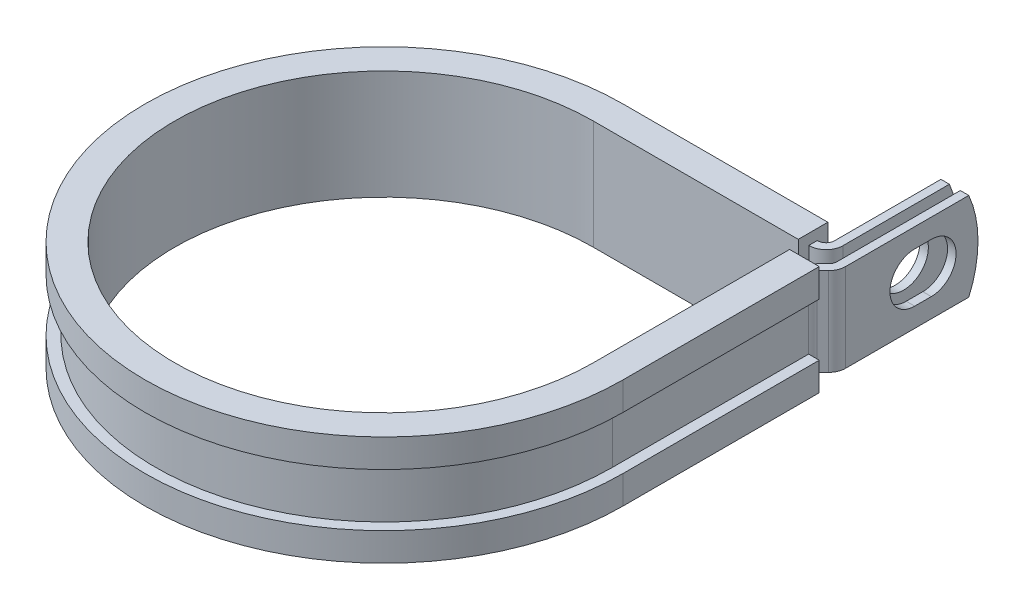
ISO-10303-21;
HEADER;
FILE_DESCRIPTION(('STEP AP214'),'2;1');
FILE_NAME('part.step','',(''),(''),'','','');
FILE_SCHEMA(('AUTOMOTIVE_DESIGN { 1 0 10303 214 1 1 1 1 }'));
ENDSEC;
DATA;
#1=APPLICATION_CONTEXT('core data for automotive mechanical design processes');
#2=APPLICATION_PROTOCOL_DEFINITION('international standard','automotive_design',2000,#1);
#3=PRODUCT_CONTEXT('',#1,'mechanical');
#4=PRODUCT('Part','Part','',(#3));
#5=PRODUCT_RELATED_PRODUCT_CATEGORY('part','',(#4));
#6=PRODUCT_DEFINITION_FORMATION('','',#4);
#7=PRODUCT_DEFINITION_CONTEXT('part definition',#1,'design');
#8=PRODUCT_DEFINITION('design','',#6,#7);
#9=PRODUCT_DEFINITION_SHAPE('','',#8);
#10=(LENGTH_UNIT() NAMED_UNIT(*) SI_UNIT(.MILLI.,.METRE.));
#11=(NAMED_UNIT(*) PLANE_ANGLE_UNIT() SI_UNIT($,.RADIAN.));
#12=(NAMED_UNIT(*) SI_UNIT($,.STERADIAN.) SOLID_ANGLE_UNIT());
#13=UNCERTAINTY_MEASURE_WITH_UNIT(LENGTH_MEASURE(1.E-05),#10,'distance_accuracy_value','');
#14=(GEOMETRIC_REPRESENTATION_CONTEXT(3) GLOBAL_UNCERTAINTY_ASSIGNED_CONTEXT((#13)) GLOBAL_UNIT_ASSIGNED_CONTEXT((#10,
#11,#12)) REPRESENTATION_CONTEXT('',''));
#15=CARTESIAN_POINT('',(0.,0.,0.));
#16=DIRECTION('',(0.,0.,1.));
#17=DIRECTION('',(1.,0.,0.));
#18=AXIS2_PLACEMENT_3D('',#15,#16,#17);
#19=CARTESIAN_POINT('',(32.3647698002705,-6.35,-31.6865));
#20=DIRECTION('',(0.,1.,0.));
#21=DIRECTION('',(1.,0.,0.));
#22=AXIS2_PLACEMENT_3D('',#19,#20,#21);
#23=PLANE('',#22);
#24=DIRECTION('',(0.,0.,-1.));
#25=VECTOR('',#24,1.);
#26=CARTESIAN_POINT('',(29.5199698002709,-6.35,-31.6865));
#27=LINE('',#26,#25);
#28=CARTESIAN_POINT('',(29.5199698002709,-6.35,-31.6865));
#29=VERTEX_POINT('',#28);
#30=CARTESIAN_POINT('',(29.5199698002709,-6.35,-32.9057));
#31=VERTEX_POINT('',#30);
#32=EDGE_CURVE('E524',#29,#31,#27,.T.);
#33=ORIENTED_EDGE('',*,*,#32,.T.);
#34=DIRECTION('',(1.,0.,0.));
#35=VECTOR('',#34,1.);
#36=CARTESIAN_POINT('',(0.,-6.35,-32.9057));
#37=LINE('',#36,#35);
#38=CARTESIAN_POINT('',(29.5707698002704,-6.35,-32.9057));
#39=VERTEX_POINT('',#38);
#40=EDGE_CURVE('E411',#39,#31,#37,.F.);
#41=ORIENTED_EDGE('',*,*,#40,.F.);
#42=CARTESIAN_POINT('',(29.5707698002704,-6.35,-34.1249));
#43=DIRECTION('',(0.,1.,0.));
#44=DIRECTION('',(1.,0.,0.));
#45=AXIS2_PLACEMENT_3D('',#42,#43,#44);
#46=CIRCLE('',#45,1.2192);
#47=CARTESIAN_POINT('',(30.7899698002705,-6.35,-34.1249));
#48=VERTEX_POINT('',#47);
#49=EDGE_CURVE('E409',#48,#39,#46,.F.);
#50=ORIENTED_EDGE('',*,*,#49,.F.);
#51=DIRECTION('',(0.,0.,1.));
#52=VECTOR('',#51,1.);
#53=CARTESIAN_POINT('',(30.7899698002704,-6.35,-50.7746));
#54=LINE('',#53,#52);
#55=CARTESIAN_POINT('',(30.7899698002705,-6.35,-49.4492778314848));
#56=VERTEX_POINT('',#55);
#57=EDGE_CURVE('E407',#56,#48,#54,.T.);
#58=ORIENTED_EDGE('',*,*,#57,.F.);
#59=DIRECTION('',(-1.,0.,0.));
#60=VECTOR('',#59,1.);
#61=CARTESIAN_POINT('',(34.8031698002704,-6.35,-49.4492778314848));
#62=LINE('',#61,#60);
#63=CARTESIAN_POINT('',(32.0091698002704,-6.35,-49.4492778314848));
#64=VERTEX_POINT('',#63);
#65=EDGE_CURVE('E12',#64,#56,#62,.T.);
#66=ORIENTED_EDGE('',*,*,#65,.F.);
#67=DIRECTION('',(0.,0.,1.));
#68=VECTOR('',#67,1.);
#69=CARTESIAN_POINT('',(32.0091698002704,-6.35,-50.7746));
#70=LINE('',#69,#68);
#71=CARTESIAN_POINT('',(32.0091698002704,-6.35,-34.1249));
#72=VERTEX_POINT('',#71);
#73=EDGE_CURVE('E405',#64,#72,#70,.T.);
#74=ORIENTED_EDGE('',*,*,#73,.T.);
#75=CARTESIAN_POINT('',(29.5707698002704,-6.35,-34.1249));
#76=DIRECTION('',(0.,-1.,0.));
#77=DIRECTION('',(0.,0.,1.));
#78=AXIS2_PLACEMENT_3D('',#75,#76,#77);
#79=CIRCLE('',#78,2.4384);
#80=CARTESIAN_POINT('',(29.5707698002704,-6.35,-31.6865));
#81=VERTEX_POINT('',#80);
#82=EDGE_CURVE('E402',#72,#81,#79,.T.);
#83=ORIENTED_EDGE('',*,*,#82,.T.);
#84=DIRECTION('',(-1.,0.,0.));
#85=VECTOR('',#84,1.);
#86=CARTESIAN_POINT('',(0.,-6.35,-31.6865));
#87=LINE('',#86,#85);
#88=EDGE_CURVE('E399',#81,#29,#87,.T.);
#89=ORIENTED_EDGE('',*,*,#88,.T.);
#90=EDGE_LOOP('',(#33,#41,#50,#58,#66,#74,#83,#89));
#91=FACE_BOUND('',#90,.T.);
#92=ADVANCED_FACE('F55',(#91),#23,.F.);
#93=CARTESIAN_POINT('',(32.3647698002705,6.35,-31.6865));
#94=DIRECTION('',(0.,1.,0.));
#95=DIRECTION('',(1.,0.,0.));
#96=AXIS2_PLACEMENT_3D('',#93,#94,#95);
#97=PLANE('',#96);
#98=DIRECTION('',(1.,0.,0.));
#99=VECTOR('',#98,1.);
#100=CARTESIAN_POINT('',(0.,6.35,-32.9057));
#101=LINE('',#100,#99);
#102=CARTESIAN_POINT('',(29.5707698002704,6.35,-32.9057));
#103=VERTEX_POINT('',#102);
#104=CARTESIAN_POINT('',(29.5199698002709,6.35,-32.9057));
#105=VERTEX_POINT('',#104);
#106=EDGE_CURVE('E369',#103,#105,#101,.F.);
#107=ORIENTED_EDGE('',*,*,#106,.T.);
#108=DIRECTION('',(0.,0.,1.));
#109=VECTOR('',#108,1.);
#110=CARTESIAN_POINT('',(29.5199698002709,6.35,-32.9057));
#111=LINE('',#110,#109);
#112=CARTESIAN_POINT('',(29.5199698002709,6.35,-31.6865));
#113=VERTEX_POINT('',#112);
#114=EDGE_CURVE('E518',#105,#113,#111,.T.);
#115=ORIENTED_EDGE('',*,*,#114,.T.);
#116=DIRECTION('',(-1.,0.,0.));
#117=VECTOR('',#116,1.);
#118=CARTESIAN_POINT('',(0.,6.35,-31.6865));
#119=LINE('',#118,#117);
#120=CARTESIAN_POINT('',(29.5707698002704,6.35,-31.6865));
#121=VERTEX_POINT('',#120);
#122=EDGE_CURVE('E626',#121,#113,#119,.T.);
#123=ORIENTED_EDGE('',*,*,#122,.F.);
#124=CARTESIAN_POINT('',(29.5707698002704,6.35,-34.1249));
#125=DIRECTION('',(0.,-1.,0.));
#126=DIRECTION('',(0.,0.,1.));
#127=AXIS2_PLACEMENT_3D('',#124,#125,#126);
#128=CIRCLE('',#127,2.4384);
#129=CARTESIAN_POINT('',(32.0091698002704,6.35,-34.1249));
#130=VERTEX_POINT('',#129);
#131=EDGE_CURVE('E371',#130,#121,#128,.T.);
#132=ORIENTED_EDGE('',*,*,#131,.F.);
#133=DIRECTION('',(0.,0.,1.));
#134=VECTOR('',#133,1.);
#135=CARTESIAN_POINT('',(32.0091698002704,6.35,-50.7746));
#136=LINE('',#135,#134);
#137=CARTESIAN_POINT('',(32.0091698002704,6.35,-49.4492778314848));
#138=VERTEX_POINT('',#137);
#139=EDGE_CURVE('E362',#138,#130,#136,.T.);
#140=ORIENTED_EDGE('',*,*,#139,.F.);
#141=DIRECTION('',(-1.,0.,0.));
#142=VECTOR('',#141,1.);
#143=CARTESIAN_POINT('',(34.8031698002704,6.35,-49.4492778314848));
#144=LINE('',#143,#142);
#145=CARTESIAN_POINT('',(30.7899698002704,6.35,-49.4492778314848));
#146=VERTEX_POINT('',#145);
#147=EDGE_CURVE('E63',#138,#146,#144,.T.);
#148=ORIENTED_EDGE('',*,*,#147,.T.);
#149=DIRECTION('',(0.,0.,1.));
#150=VECTOR('',#149,1.);
#151=CARTESIAN_POINT('',(30.7899698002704,6.35,-50.7746));
#152=LINE('',#151,#150);
#153=CARTESIAN_POINT('',(30.7899698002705,6.35,-34.1249));
#154=VERTEX_POINT('',#153);
#155=EDGE_CURVE('E359',#146,#154,#152,.T.);
#156=ORIENTED_EDGE('',*,*,#155,.T.);
#157=CARTESIAN_POINT('',(29.5707698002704,6.35,-34.1249));
#158=DIRECTION('',(0.,1.,0.));
#159=DIRECTION('',(1.,0.,0.));
#160=AXIS2_PLACEMENT_3D('',#157,#158,#159);
#161=CIRCLE('',#160,1.2192);
#162=EDGE_CURVE('E367',#154,#103,#161,.F.);
#163=ORIENTED_EDGE('',*,*,#162,.T.);
#164=EDGE_LOOP('',(#107,#115,#123,#132,#140,#148,#156,#163));
#165=FACE_BOUND('',#164,.T.);
#166=ADVANCED_FACE('F358',(#165),#97,.T.);
#167=CARTESIAN_POINT('',(0.,6.35,-31.6865));
#168=DIRECTION('',(0.,0.,1.));
#169=DIRECTION('',(1.,0.,0.));
#170=AXIS2_PLACEMENT_3D('',#167,#168,#169);
#171=PLANE('',#170);
#172=ORIENTED_EDGE('',*,*,#122,.T.);
#173=DIRECTION('',(0.,-1.,0.));
#174=VECTOR('',#173,1.);
#175=CARTESIAN_POINT('',(29.5199698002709,6.35,-31.6865));
#176=LINE('',#175,#174);
#177=EDGE_CURVE('E521',#113,#29,#176,.T.);
#178=ORIENTED_EDGE('',*,*,#177,.T.);
#179=ORIENTED_EDGE('',*,*,#88,.F.);
#180=DIRECTION('',(0.,-1.,0.));
#181=VECTOR('',#180,1.);
#182=CARTESIAN_POINT('',(29.5707698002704,6.35,-31.6865));
#183=LINE('',#182,#181);
#184=EDGE_CURVE('E345',#121,#81,#183,.T.);
#185=ORIENTED_EDGE('',*,*,#184,.F.);
#186=EDGE_LOOP('',(#172,#178,#179,#185));
#187=FACE_BOUND('',#186,.T.);
#188=ADVANCED_FACE('F636',(#187),#171,.T.);
#189=CARTESIAN_POINT('',(34.8031698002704,6.35,-31.6865));
#190=DIRECTION('',(-1.,0.,0.));
#191=DIRECTION('',(0.,0.,1.));
#192=AXIS2_PLACEMENT_3D('',#189,#190,#191);
#193=PLANE('',#192);
#194=CARTESIAN_POINT('',(34.8031698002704,0.,-44.0435999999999));
#195=DIRECTION('',(1.,0.,0.));
#196=DIRECTION('',(0.,0.,-1.));
#197=AXIS2_PLACEMENT_3D('',#194,#195,#196);
#198=CIRCLE('',#197,3.5687);
#199=CARTESIAN_POINT('',(34.8031698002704,-3.5687,-44.0436000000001));
#200=VERTEX_POINT('',#199);
#201=CARTESIAN_POINT('',(34.8031698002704,3.5687,-44.0436000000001));
#202=VERTEX_POINT('',#201);
#203=EDGE_CURVE('E581',#200,#202,#198,.T.);
#204=ORIENTED_EDGE('',*,*,#203,.F.);
#205=DIRECTION('',(0.,0.,-1.));
#206=VECTOR('',#205,1.);
#207=CARTESIAN_POINT('',(34.8031698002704,-3.5687,-41.6559999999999));
#208=LINE('',#207,#206);
#209=CARTESIAN_POINT('',(34.8031698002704,-3.5687,-41.6559999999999));
#210=VERTEX_POINT('',#209);
#211=EDGE_CURVE('E584',#210,#200,#208,.T.);
#212=ORIENTED_EDGE('',*,*,#211,.F.);
#213=CARTESIAN_POINT('',(34.8031698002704,0.,-41.6559999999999));
#214=DIRECTION('',(1.,0.,0.));
#215=DIRECTION('',(0.,0.,-1.));
#216=AXIS2_PLACEMENT_3D('',#213,#214,#215);
#217=CIRCLE('',#216,3.5687);
#218=CARTESIAN_POINT('',(34.8031698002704,3.5687,-41.6559999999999));
#219=VERTEX_POINT('',#218);
#220=EDGE_CURVE('E577',#219,#210,#217,.T.);
#221=ORIENTED_EDGE('',*,*,#220,.F.);
#222=DIRECTION('',(0.,0.,1.));
#223=VECTOR('',#222,1.);
#224=CARTESIAN_POINT('',(34.8031698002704,3.5687,-41.6559999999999));
#225=LINE('',#224,#223);
#226=EDGE_CURVE('E578',#202,#219,#225,.T.);
#227=ORIENTED_EDGE('',*,*,#226,.F.);
#228=EDGE_LOOP('',(#204,#212,#221,#227));
#229=FACE_BOUND('',#228,.T.);
#230=DIRECTION('',(0.,0.,-1.));
#231=VECTOR('',#230,1.);
#232=CARTESIAN_POINT('',(34.8031698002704,-6.35,-31.6865));
#233=LINE('',#232,#231);
#234=CARTESIAN_POINT('',(34.8031698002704,-6.35,-31.6865));
#235=VERTEX_POINT('',#234);
#236=CARTESIAN_POINT('',(34.8031698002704,-6.35,-49.4492778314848));
#237=VERTEX_POINT('',#236);
#238=EDGE_CURVE('E383',#235,#237,#233,.T.);
#239=ORIENTED_EDGE('',*,*,#238,.T.);
#240=CARTESIAN_POINT('',(34.8031698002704,0.,-34.8996));
#241=DIRECTION('',(-1.,0.,0.));
#242=DIRECTION('',(0.,0.,1.));
#243=AXIS2_PLACEMENT_3D('',#240,#241,#242);
#244=CIRCLE('',#243,15.875);
#245=CARTESIAN_POINT('',(34.8031698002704,6.35,-49.4492778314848));
#246=VERTEX_POINT('',#245);
#247=EDGE_CURVE('E569',#246,#237,#244,.T.);
#248=ORIENTED_EDGE('',*,*,#247,.F.);
#249=DIRECTION('',(0.,0.,-1.));
#250=VECTOR('',#249,1.);
#251=CARTESIAN_POINT('',(34.8031698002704,6.35,-31.6865));
#252=LINE('',#251,#250);
#253=CARTESIAN_POINT('',(34.8031698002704,6.35,-31.6865));
#254=VERTEX_POINT('',#253);
#255=EDGE_CURVE('E420',#254,#246,#252,.T.);
#256=ORIENTED_EDGE('',*,*,#255,.F.);
#257=DIRECTION('',(0.,-1.,0.));
#258=VECTOR('',#257,1.);
#259=CARTESIAN_POINT('',(34.8031698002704,6.35,-31.6865));
#260=LINE('',#259,#258);
#261=EDGE_CURVE('E382',#254,#235,#260,.T.);
#262=ORIENTED_EDGE('',*,*,#261,.T.);
#263=EDGE_LOOP('',(#239,#248,#256,#262));
#264=FACE_BOUND('',#263,.T.);
#265=ADVANCED_FACE('F57',(#229,#264),#193,.F.);
#266=CARTESIAN_POINT('',(33.5839698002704,6.35,-31.6865));
#267=DIRECTION('',(-1.,0.,0.));
#268=DIRECTION('',(0.,0.,1.));
#269=AXIS2_PLACEMENT_3D('',#266,#267,#268);
#270=PLANE('',#269);
#271=DIRECTION('',(0.,0.,-1.));
#272=VECTOR('',#271,1.);
#273=CARTESIAN_POINT('',(33.5839698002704,-3.5687,-41.6559999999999));
#274=LINE('',#273,#272);
#275=CARTESIAN_POINT('',(33.5839698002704,-3.5687,-41.6559999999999));
#276=VERTEX_POINT('',#275);
#277=CARTESIAN_POINT('',(33.5839698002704,-3.5687,-44.0436000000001));
#278=VERTEX_POINT('',#277);
#279=EDGE_CURVE('E580',#276,#278,#274,.T.);
#280=ORIENTED_EDGE('',*,*,#279,.T.);
#281=CARTESIAN_POINT('',(33.5839698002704,0.,-44.0435999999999));
#282=DIRECTION('',(-1.,0.,0.));
#283=DIRECTION('',(0.,0.,1.));
#284=AXIS2_PLACEMENT_3D('',#281,#282,#283);
#285=CIRCLE('',#284,3.5687);
#286=CARTESIAN_POINT('',(33.5839698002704,3.5687,-44.0436000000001));
#287=VERTEX_POINT('',#286);
#288=EDGE_CURVE('E601',#278,#287,#285,.F.);
#289=ORIENTED_EDGE('',*,*,#288,.T.);
#290=DIRECTION('',(0.,0.,1.));
#291=VECTOR('',#290,1.);
#292=CARTESIAN_POINT('',(33.5839698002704,3.5687,-41.6559999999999));
#293=LINE('',#292,#291);
#294=CARTESIAN_POINT('',(33.5839698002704,3.5687,-41.6559999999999));
#295=VERTEX_POINT('',#294);
#296=EDGE_CURVE('E597',#287,#295,#293,.T.);
#297=ORIENTED_EDGE('',*,*,#296,.T.);
#298=CARTESIAN_POINT('',(33.5839698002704,0.,-41.6559999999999));
#299=DIRECTION('',(-1.,0.,0.));
#300=DIRECTION('',(0.,0.,1.));
#301=AXIS2_PLACEMENT_3D('',#298,#299,#300);
#302=CIRCLE('',#301,3.5687);
#303=EDGE_CURVE('E592',#295,#276,#302,.F.);
#304=ORIENTED_EDGE('',*,*,#303,.T.);
#305=EDGE_LOOP('',(#280,#289,#297,#304));
#306=FACE_BOUND('',#305,.T.);
#307=CARTESIAN_POINT('',(33.5839698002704,0.,-34.8996));
#308=DIRECTION('',(-1.,0.,0.));
#309=DIRECTION('',(0.,0.,1.));
#310=AXIS2_PLACEMENT_3D('',#307,#308,#309);
#311=CIRCLE('',#310,15.875);
#312=CARTESIAN_POINT('',(33.5839698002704,6.35,-49.4492778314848));
#313=VERTEX_POINT('',#312);
#314=CARTESIAN_POINT('',(33.5839698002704,-6.35,-49.4492778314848));
#315=VERTEX_POINT('',#314);
#316=EDGE_CURVE('E77',#313,#315,#311,.T.);
#317=ORIENTED_EDGE('',*,*,#316,.T.);
#318=DIRECTION('',(0.,0.,-1.));
#319=VECTOR('',#318,1.);
#320=CARTESIAN_POINT('',(33.5839698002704,-6.35,-31.6865));
#321=LINE('',#320,#319);
#322=CARTESIAN_POINT('',(33.5839698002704,-6.35,-31.6865));
#323=VERTEX_POINT('',#322);
#324=EDGE_CURVE('E386',#323,#315,#321,.T.);
#325=ORIENTED_EDGE('',*,*,#324,.F.);
#326=DIRECTION('',(0.,-1.,0.));
#327=VECTOR('',#326,1.);
#328=CARTESIAN_POINT('',(33.5839698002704,6.35,-31.6865));
#329=LINE('',#328,#327);
#330=CARTESIAN_POINT('',(33.5839698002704,6.35,-31.6865));
#331=VERTEX_POINT('',#330);
#332=EDGE_CURVE('E353',#331,#323,#329,.T.);
#333=ORIENTED_EDGE('',*,*,#332,.F.);
#334=DIRECTION('',(0.,0.,-1.));
#335=VECTOR('',#334,1.);
#336=CARTESIAN_POINT('',(33.5839698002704,6.35,-31.6865));
#337=LINE('',#336,#335);
#338=EDGE_CURVE('E616',#331,#313,#337,.T.);
#339=ORIENTED_EDGE('',*,*,#338,.T.);
#340=EDGE_LOOP('',(#317,#325,#333,#339));
#341=FACE_BOUND('',#340,.T.);
#342=ADVANCED_FACE('F690',(#306,#341),#270,.T.);
#343=CARTESIAN_POINT('',(32.0091698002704,6.35,-50.7746));
#344=DIRECTION('',(1.,0.,0.));
#345=DIRECTION('',(0.,0.,-1.));
#346=AXIS2_PLACEMENT_3D('',#343,#344,#345);
#347=PLANE('',#346);
#348=CARTESIAN_POINT('',(32.0091698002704,0.,-42.8498));
#349=DIRECTION('',(1.,0.,0.));
#350=DIRECTION('',(0.,0.,-1.));
#351=AXIS2_PLACEMENT_3D('',#348,#349,#350);
#352=CIRCLE('',#351,3.5687);
#353=CARTESIAN_POINT('',(32.0091698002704,0.,-46.4185));
#354=VERTEX_POINT('',#353);
#355=EDGE_CURVE('E387',#354,#354,#352,.F.);
#356=ORIENTED_EDGE('',*,*,#355,.T.);
#357=EDGE_LOOP('',(#356));
#358=FACE_BOUND('',#357,.T.);
#359=ORIENTED_EDGE('',*,*,#73,.F.);
#360=CARTESIAN_POINT('',(32.0091698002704,0.,-34.8996));
#361=DIRECTION('',(1.,0.,0.));
#362=DIRECTION('',(0.,0.,-1.));
#363=AXIS2_PLACEMENT_3D('',#360,#361,#362);
#364=CIRCLE('',#363,15.875);
#365=EDGE_CURVE('E574',#64,#138,#364,.T.);
#366=ORIENTED_EDGE('',*,*,#365,.T.);
#367=ORIENTED_EDGE('',*,*,#139,.T.);
#368=DIRECTION('',(0.,-1.,0.));
#369=VECTOR('',#368,1.);
#370=CARTESIAN_POINT('',(32.0091698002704,6.35,-34.1249));
#371=LINE('',#370,#369);
#372=EDGE_CURVE('E342',#130,#72,#371,.T.);
#373=ORIENTED_EDGE('',*,*,#372,.T.);
#374=EDGE_LOOP('',(#359,#366,#367,#373));
#375=FACE_BOUND('',#374,.T.);
#376=ADVANCED_FACE('F642',(#358,#375),#347,.T.);
#377=CARTESIAN_POINT('',(30.7899698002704,6.35,-50.7746));
#378=DIRECTION('',(1.,0.,0.));
#379=DIRECTION('',(0.,0.,-1.));
#380=AXIS2_PLACEMENT_3D('',#377,#378,#379);
#381=PLANE('',#380);
#382=CARTESIAN_POINT('',(30.7899698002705,0.,-42.8498));
#383=DIRECTION('',(-1.,0.,0.));
#384=DIRECTION('',(0.,0.,1.));
#385=AXIS2_PLACEMENT_3D('',#382,#383,#384);
#386=CIRCLE('',#385,3.5687);
#387=CARTESIAN_POINT('',(30.7899698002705,0.,-39.2811));
#388=VERTEX_POINT('',#387);
#389=EDGE_CURVE('E609',#388,#388,#386,.T.);
#390=ORIENTED_EDGE('',*,*,#389,.F.);
#391=EDGE_LOOP('',(#390));
#392=FACE_BOUND('',#391,.T.);
#393=CARTESIAN_POINT('',(30.7899698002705,0.,-34.8996));
#394=DIRECTION('',(-1.,0.,0.));
#395=DIRECTION('',(0.,0.,1.));
#396=AXIS2_PLACEMENT_3D('',#393,#394,#395);
#397=CIRCLE('',#396,15.875);
#398=EDGE_CURVE('E69',#146,#56,#397,.T.);
#399=ORIENTED_EDGE('',*,*,#398,.T.);
#400=ORIENTED_EDGE('',*,*,#57,.T.);
#401=DIRECTION('',(0.,-1.,0.));
#402=VECTOR('',#401,1.);
#403=CARTESIAN_POINT('',(30.7899698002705,6.35,-34.1249));
#404=LINE('',#403,#402);
#405=EDGE_CURVE('E339',#154,#48,#404,.T.);
#406=ORIENTED_EDGE('',*,*,#405,.F.);
#407=ORIENTED_EDGE('',*,*,#155,.F.);
#408=EDGE_LOOP('',(#399,#400,#406,#407));
#409=FACE_BOUND('',#408,.T.);
#410=ADVANCED_FACE('F365',(#392,#409),#381,.F.);
#411=CARTESIAN_POINT('',(34.1249,-6.35,-28.2740026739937));
#412=DIRECTION('',(0.,1.,0.));
#413=DIRECTION('',(1.,0.,0.));
#414=AXIS2_PLACEMENT_3D('',#411,#412,#413);
#415=CIRCLE('',#414,1.2192);
#416=CARTESIAN_POINT('',(32.9057,-6.35,-28.2740026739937));
#417=VERTEX_POINT('',#416);
#418=CARTESIAN_POINT('',(33.2627954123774,-6.35,-29.1361072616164));
#419=VERTEX_POINT('',#418);
#420=EDGE_CURVE('E414',#417,#419,#415,.F.);
#421=ORIENTED_EDGE('',*,*,#420,.F.);
#422=DIRECTION('',(1.,0.,0.));
#423=VECTOR('',#422,1.);
#424=CARTESIAN_POINT('',(31.6865,-6.35,-28.2740026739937));
#425=LINE('',#424,#423);
#426=CARTESIAN_POINT('',(31.6865,-6.35,-28.2740026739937));
#427=VERTEX_POINT('',#426);
#428=EDGE_CURVE('E452',#427,#417,#425,.T.);
#429=ORIENTED_EDGE('',*,*,#428,.F.);
#430=CARTESIAN_POINT('',(34.1249,-6.35,-28.2740026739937));
#431=DIRECTION('',(0.,-1.,0.));
#432=DIRECTION('',(0.,0.,1.));
#433=AXIS2_PLACEMENT_3D('',#430,#431,#432);
#434=CIRCLE('',#433,2.4384);
#435=CARTESIAN_POINT('',(32.4006908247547,-6.35,-29.998211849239));
#436=VERTEX_POINT('',#435);
#437=EDGE_CURVE('E396',#427,#436,#434,.T.);
#438=ORIENTED_EDGE('',*,*,#437,.T.);
#439=DIRECTION('',(0.707106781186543,0.,-0.707106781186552));
#440=VECTOR('',#439,1.);
#441=CARTESIAN_POINT('',(32.4006908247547,-6.35,-29.998211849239));
#442=LINE('',#441,#440);
#443=CARTESIAN_POINT('',(33.2268743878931,-6.35,-30.8243954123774));
#444=VERTEX_POINT('',#443);
#445=EDGE_CURVE('E393',#436,#444,#442,.T.);
#446=ORIENTED_EDGE('',*,*,#445,.T.);
#447=CARTESIAN_POINT('',(32.3647698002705,-6.35,-31.6865));
#448=DIRECTION('',(0.,1.,0.));
#449=DIRECTION('',(0.,0.,1.));
#450=AXIS2_PLACEMENT_3D('',#447,#448,#449);
#451=CIRCLE('',#450,1.21919999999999);
#452=EDGE_CURVE('E390',#444,#323,#451,.T.);
#453=ORIENTED_EDGE('',*,*,#452,.T.);
#454=ORIENTED_EDGE('',*,*,#324,.T.);
#455=DIRECTION('',(-1.,0.,0.));
#456=VECTOR('',#455,1.);
#457=CARTESIAN_POINT('',(34.8031698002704,-6.35,-49.4492778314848));
#458=LINE('',#457,#456);
#459=EDGE_CURVE('E567',#237,#315,#458,.T.);
#460=ORIENTED_EDGE('',*,*,#459,.F.);
#461=ORIENTED_EDGE('',*,*,#238,.F.);
#462=CARTESIAN_POINT('',(32.3647698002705,-6.35,-31.6865));
#463=DIRECTION('',(0.,1.,0.));
#464=DIRECTION('',(1.,0.,0.));
#465=AXIS2_PLACEMENT_3D('',#462,#463,#464);
#466=CIRCLE('',#465,2.43839999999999);
#467=CARTESIAN_POINT('',(34.0889789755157,-6.35,-29.9622908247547));
#468=VERTEX_POINT('',#467);
#469=EDGE_CURVE('E418',#468,#235,#466,.T.);
#470=ORIENTED_EDGE('',*,*,#469,.F.);
#471=DIRECTION('',(0.707106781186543,0.,-0.707106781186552));
#472=VECTOR('',#471,1.);
#473=CARTESIAN_POINT('',(33.2627954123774,-6.35,-29.1361072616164));
#474=LINE('',#473,#472);
#475=EDGE_CURVE('E416',#419,#468,#474,.T.);
#476=ORIENTED_EDGE('',*,*,#475,.F.);
#477=EDGE_LOOP('',(#421,#429,#438,#446,#453,#454,#460,#461,#470,#476));
#478=FACE_BOUND('',#477,.T.);
#479=ADVANCED_FACE('F676',(#478),#23,.F.);
#480=DIRECTION('',(-1.,0.,0.));
#481=VECTOR('',#480,1.);
#482=CARTESIAN_POINT('',(32.9057,6.35,-28.2740026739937));
#483=LINE('',#482,#481);
#484=CARTESIAN_POINT('',(32.9057,6.35,-28.2740026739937));
#485=VERTEX_POINT('',#484);
#486=CARTESIAN_POINT('',(31.6865,6.35,-28.2740026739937));
#487=VERTEX_POINT('',#486);
#488=EDGE_CURVE('E441',#485,#487,#483,.T.);
#489=ORIENTED_EDGE('',*,*,#488,.F.);
#490=CARTESIAN_POINT('',(34.1249,6.35,-28.2740026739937));
#491=DIRECTION('',(0.,1.,0.));
#492=DIRECTION('',(1.,0.,0.));
#493=AXIS2_PLACEMENT_3D('',#490,#491,#492);
#494=CIRCLE('',#493,1.2192);
#495=CARTESIAN_POINT('',(33.2627954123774,6.35,-29.1361072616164));
#496=VERTEX_POINT('',#495);
#497=EDGE_CURVE('E376',#485,#496,#494,.F.);
#498=ORIENTED_EDGE('',*,*,#497,.T.);
#499=DIRECTION('',(0.707106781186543,0.,-0.707106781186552));
#500=VECTOR('',#499,1.);
#501=CARTESIAN_POINT('',(33.2627954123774,6.35,-29.1361072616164));
#502=LINE('',#501,#500);
#503=CARTESIAN_POINT('',(34.0889789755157,6.35,-29.9622908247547));
#504=VERTEX_POINT('',#503);
#505=EDGE_CURVE('E378',#496,#504,#502,.T.);
#506=ORIENTED_EDGE('',*,*,#505,.T.);
#507=CARTESIAN_POINT('',(32.3647698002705,6.35,-31.6865));
#508=DIRECTION('',(0.,1.,0.));
#509=DIRECTION('',(1.,0.,0.));
#510=AXIS2_PLACEMENT_3D('',#507,#508,#509);
#511=CIRCLE('',#510,2.43839999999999);
#512=EDGE_CURVE('E380',#504,#254,#511,.T.);
#513=ORIENTED_EDGE('',*,*,#512,.T.);
#514=ORIENTED_EDGE('',*,*,#255,.T.);
#515=DIRECTION('',(-1.,0.,0.));
#516=VECTOR('',#515,1.);
#517=CARTESIAN_POINT('',(34.8031698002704,6.35,-49.4492778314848));
#518=LINE('',#517,#516);
#519=EDGE_CURVE('E571',#246,#313,#518,.T.);
#520=ORIENTED_EDGE('',*,*,#519,.T.);
#521=ORIENTED_EDGE('',*,*,#338,.F.);
#522=CARTESIAN_POINT('',(32.3647698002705,6.35,-31.6865));
#523=DIRECTION('',(0.,1.,0.));
#524=DIRECTION('',(0.,0.,1.));
#525=AXIS2_PLACEMENT_3D('',#522,#523,#524);
#526=CIRCLE('',#525,1.21919999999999);
#527=CARTESIAN_POINT('',(33.2268743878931,6.35,-30.8243954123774));
#528=VERTEX_POINT('',#527);
#529=EDGE_CURVE('E619',#528,#331,#526,.T.);
#530=ORIENTED_EDGE('',*,*,#529,.F.);
#531=DIRECTION('',(0.707106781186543,0.,-0.707106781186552));
#532=VECTOR('',#531,1.);
#533=CARTESIAN_POINT('',(32.4006908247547,6.35,-29.998211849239));
#534=LINE('',#533,#532);
#535=CARTESIAN_POINT('',(32.4006908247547,6.35,-29.998211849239));
#536=VERTEX_POINT('',#535);
#537=EDGE_CURVE('E622',#536,#528,#534,.T.);
#538=ORIENTED_EDGE('',*,*,#537,.F.);
#539=CARTESIAN_POINT('',(34.1249,6.35,-28.2740026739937));
#540=DIRECTION('',(0.,-1.,0.));
#541=DIRECTION('',(0.,0.,1.));
#542=AXIS2_PLACEMENT_3D('',#539,#540,#541);
#543=CIRCLE('',#542,2.4384);
#544=EDGE_CURVE('E451',#487,#536,#543,.T.);
#545=ORIENTED_EDGE('',*,*,#544,.F.);
#546=EDGE_LOOP('',(#489,#498,#506,#513,#514,#520,#521,#530,#538,#545));
#547=FACE_BOUND('',#546,.T.);
#548=ADVANCED_FACE('F448',(#547),#97,.T.);
#549=CARTESIAN_POINT('',(32.3647698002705,6.35,-31.6865));
#550=DIRECTION('',(0.,-1.,0.));
#551=DIRECTION('',(0.,0.,-1.));
#552=AXIS2_PLACEMENT_3D('',#549,#550,#551);
#553=CYLINDRICAL_SURFACE('',#552,1.21919999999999);
#554=ORIENTED_EDGE('',*,*,#452,.F.);
#555=DIRECTION('',(0.,-1.,0.));
#556=VECTOR('',#555,1.);
#557=CARTESIAN_POINT('',(33.2268743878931,6.35,-30.8243954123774));
#558=LINE('',#557,#556);
#559=EDGE_CURVE('E351',#528,#444,#558,.T.);
#560=ORIENTED_EDGE('',*,*,#559,.F.);
#561=ORIENTED_EDGE('',*,*,#529,.T.);
#562=ORIENTED_EDGE('',*,*,#332,.T.);
#563=EDGE_LOOP('',(#554,#560,#561,#562));
#564=FACE_BOUND('',#563,.T.);
#565=ADVANCED_FACE('F686',(#564),#553,.F.);
#566=CARTESIAN_POINT('',(32.4006908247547,6.35,-29.998211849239));
#567=DIRECTION('',(-0.707106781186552,0.,-0.707106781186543));
#568=DIRECTION('',(-0.707106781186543,0.,0.707106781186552));
#569=AXIS2_PLACEMENT_3D('',#566,#567,#568);
#570=PLANE('',#569);
#571=ORIENTED_EDGE('',*,*,#445,.F.);
#572=DIRECTION('',(0.,-1.,0.));
#573=VECTOR('',#572,1.);
#574=CARTESIAN_POINT('',(32.4006908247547,6.35,-29.998211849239));
#575=LINE('',#574,#573);
#576=EDGE_CURVE('E349',#536,#436,#575,.T.);
#577=ORIENTED_EDGE('',*,*,#576,.F.);
#578=ORIENTED_EDGE('',*,*,#537,.T.);
#579=ORIENTED_EDGE('',*,*,#559,.T.);
#580=EDGE_LOOP('',(#571,#577,#578,#579));
#581=FACE_BOUND('',#580,.T.);
#582=ADVANCED_FACE('F681',(#581),#570,.T.);
#583=CARTESIAN_POINT('',(34.1249,6.35,-28.2740026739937));
#584=DIRECTION('',(0.,-1.,0.));
#585=DIRECTION('',(0.,0.,-1.));
#586=AXIS2_PLACEMENT_3D('',#583,#584,#585);
#587=CYLINDRICAL_SURFACE('',#586,2.4384);
#588=ORIENTED_EDGE('',*,*,#437,.F.);
#589=DIRECTION('',(0.,-1.,0.));
#590=VECTOR('',#589,1.);
#591=CARTESIAN_POINT('',(31.6865,6.35,-28.2740026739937));
#592=LINE('',#591,#590);
#593=EDGE_CURVE('E347',#487,#427,#592,.T.);
#594=ORIENTED_EDGE('',*,*,#593,.F.);
#595=ORIENTED_EDGE('',*,*,#544,.T.);
#596=ORIENTED_EDGE('',*,*,#576,.T.);
#597=EDGE_LOOP('',(#588,#594,#595,#596));
#598=FACE_BOUND('',#597,.T.);
#599=ADVANCED_FACE('F678',(#598),#587,.T.);
#600=CARTESIAN_POINT('',(29.5707698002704,6.35,-34.1249));
#601=DIRECTION('',(0.,-1.,0.));
#602=DIRECTION('',(0.,0.,-1.));
#603=AXIS2_PLACEMENT_3D('',#600,#601,#602);
#604=CYLINDRICAL_SURFACE('',#603,2.4384);
#605=ORIENTED_EDGE('',*,*,#82,.F.);
#606=ORIENTED_EDGE('',*,*,#372,.F.);
#607=ORIENTED_EDGE('',*,*,#131,.T.);
#608=ORIENTED_EDGE('',*,*,#184,.T.);
#609=EDGE_LOOP('',(#605,#606,#607,#608));
#610=FACE_BOUND('',#609,.T.);
#611=ADVANCED_FACE('F632',(#610),#604,.T.);
#612=CARTESIAN_POINT('',(29.5707698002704,6.35,-34.1249));
#613=DIRECTION('',(0.,-1.,0.));
#614=DIRECTION('',(0.,0.,-1.));
#615=AXIS2_PLACEMENT_3D('',#612,#613,#614);
#616=CYLINDRICAL_SURFACE('',#615,1.2192);
#617=ORIENTED_EDGE('',*,*,#49,.T.);
#618=DIRECTION('',(0.,-1.,0.));
#619=VECTOR('',#618,1.);
#620=CARTESIAN_POINT('',(29.5707698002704,6.35,-32.9057));
#621=LINE('',#620,#619);
#622=EDGE_CURVE('E330',#103,#39,#621,.T.);
#623=ORIENTED_EDGE('',*,*,#622,.F.);
#624=ORIENTED_EDGE('',*,*,#162,.F.);
#625=ORIENTED_EDGE('',*,*,#405,.T.);
#626=EDGE_LOOP('',(#617,#623,#624,#625));
#627=FACE_BOUND('',#626,.T.);
#628=ADVANCED_FACE('F647',(#627),#616,.F.);
#629=CARTESIAN_POINT('',(0.,6.35,-32.9057));
#630=DIRECTION('',(0.,0.,1.));
#631=DIRECTION('',(1.,0.,0.));
#632=AXIS2_PLACEMENT_3D('',#629,#630,#631);
#633=PLANE('',#632);
#634=DIRECTION('',(0.,-1.,0.));
#635=VECTOR('',#634,1.);
#636=CARTESIAN_POINT('',(0.,6.35,-32.9057));
#637=LINE('',#636,#635);
#638=CARTESIAN_POINT('',(4.61573442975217E-13,3.81,-32.9057));
#639=VERTEX_POINT('',#638);
#640=CARTESIAN_POINT('',(4.61573442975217E-13,-3.81,-32.9057));
#641=VERTEX_POINT('',#640);
#642=EDGE_CURVE('E321',#639,#641,#637,.T.);
#643=ORIENTED_EDGE('',*,*,#642,.F.);
#644=DIRECTION('',(1.,0.,0.));
#645=VECTOR('',#644,1.);
#646=CARTESIAN_POINT('',(4.61573442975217E-13,3.81,-32.9057));
#647=LINE('',#646,#645);
#648=CARTESIAN_POINT('',(29.5199698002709,3.81,-32.9057));
#649=VERTEX_POINT('',#648);
#650=EDGE_CURVE('E564',#639,#649,#647,.T.);
#651=ORIENTED_EDGE('',*,*,#650,.T.);
#652=DIRECTION('',(0.,1.,0.));
#653=VECTOR('',#652,1.);
#654=CARTESIAN_POINT('',(29.5199698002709,6.35,-32.9057));
#655=LINE('',#654,#653);
#656=EDGE_CURVE('E515',#649,#105,#655,.T.);
#657=ORIENTED_EDGE('',*,*,#656,.T.);
#658=ORIENTED_EDGE('',*,*,#106,.F.);
#659=ORIENTED_EDGE('',*,*,#622,.T.);
#660=ORIENTED_EDGE('',*,*,#40,.T.);
#661=DIRECTION('',(0.,1.,0.));
#662=VECTOR('',#661,1.);
#663=CARTESIAN_POINT('',(29.5199698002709,-6.35,-32.9057));
#664=LINE('',#663,#662);
#665=CARTESIAN_POINT('',(29.5199698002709,-3.81,-32.9057));
#666=VERTEX_POINT('',#665);
#667=EDGE_CURVE('E527',#31,#666,#664,.T.);
#668=ORIENTED_EDGE('',*,*,#667,.T.);
#669=DIRECTION('',(1.,0.,0.));
#670=VECTOR('',#669,1.);
#671=CARTESIAN_POINT('',(4.61573442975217E-13,-3.81,-32.9057));
#672=LINE('',#671,#670);
#673=EDGE_CURVE('E544',#641,#666,#672,.T.);
#674=ORIENTED_EDGE('',*,*,#673,.F.);
#675=EDGE_LOOP('',(#643,#651,#657,#658,#659,#660,#668,#674));
#676=FACE_BOUND('',#675,.T.);
#677=ADVANCED_FACE('F651',(#676),#633,.F.);
#678=CARTESIAN_POINT('',(0.,6.35,0.));
#679=DIRECTION('',(0.,-1.,0.));
#680=DIRECTION('',(0.,0.,-1.));
#681=AXIS2_PLACEMENT_3D('',#678,#679,#680);
#682=CYLINDRICAL_SURFACE('',#681,32.9057);
#683=DIRECTION('',(0.,-1.,0.));
#684=VECTOR('',#683,1.);
#685=CARTESIAN_POINT('',(32.9057,6.35,0.));
#686=LINE('',#685,#684);
#687=CARTESIAN_POINT('',(32.9057,3.81,0.));
#688=VERTEX_POINT('',#687);
#689=CARTESIAN_POINT('',(32.9057,-3.81,0.));
#690=VERTEX_POINT('',#689);
#691=EDGE_CURVE('E319',#688,#690,#686,.T.);
#692=ORIENTED_EDGE('',*,*,#691,.F.);
#693=CARTESIAN_POINT('',(0.,3.81,0.));
#694=DIRECTION('',(0.,-1.,0.));
#695=DIRECTION('',(0.,0.,-1.));
#696=AXIS2_PLACEMENT_3D('',#693,#694,#695);
#697=CIRCLE('',#696,32.9057);
#698=EDGE_CURVE('E513',#688,#639,#697,.T.);
#699=ORIENTED_EDGE('',*,*,#698,.T.);
#700=ORIENTED_EDGE('',*,*,#642,.T.);
#701=CARTESIAN_POINT('',(0.,-3.81,0.));
#702=DIRECTION('',(0.,-1.,0.));
#703=DIRECTION('',(0.,0.,-1.));
#704=AXIS2_PLACEMENT_3D('',#701,#702,#703);
#705=CIRCLE('',#704,32.9057);
#706=EDGE_CURVE('E302',#690,#641,#705,.T.);
#707=ORIENTED_EDGE('',*,*,#706,.F.);
#708=EDGE_LOOP('',(#692,#699,#700,#707));
#709=FACE_BOUND('',#708,.T.);
#710=ADVANCED_FACE('F317',(#709),#682,.T.);
#711=CARTESIAN_POINT('',(32.9057,6.35,0.));
#712=DIRECTION('',(-1.,0.,0.));
#713=DIRECTION('',(0.,0.,1.));
#714=AXIS2_PLACEMENT_3D('',#711,#712,#713);
#715=PLANE('',#714);
#716=DIRECTION('',(0.,-1.,0.));
#717=VECTOR('',#716,1.);
#718=CARTESIAN_POINT('',(32.9057,6.35,-28.2740026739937));
#719=LINE('',#718,#717);
#720=CARTESIAN_POINT('',(32.9057,3.81,-28.2740026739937));
#721=VERTEX_POINT('',#720);
#722=CARTESIAN_POINT('',(32.9057,-3.81,-28.2740026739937));
#723=VERTEX_POINT('',#722);
#724=EDGE_CURVE('E333',#721,#723,#719,.T.);
#725=ORIENTED_EDGE('',*,*,#724,.F.);
#726=DIRECTION('',(0.,0.,-1.));
#727=VECTOR('',#726,1.);
#728=CARTESIAN_POINT('',(32.9057,3.81,0.));
#729=LINE('',#728,#727);
#730=EDGE_CURVE('E327',#688,#721,#729,.T.);
#731=ORIENTED_EDGE('',*,*,#730,.F.);
#732=ORIENTED_EDGE('',*,*,#691,.T.);
#733=DIRECTION('',(0.,0.,-1.));
#734=VECTOR('',#733,1.);
#735=CARTESIAN_POINT('',(32.9057,-3.81,0.));
#736=LINE('',#735,#734);
#737=EDGE_CURVE('E298',#690,#723,#736,.T.);
#738=ORIENTED_EDGE('',*,*,#737,.T.);
#739=EDGE_LOOP('',(#725,#731,#732,#738));
#740=FACE_BOUND('',#739,.T.);
#741=ADVANCED_FACE('F326',(#740),#715,.F.);
#742=CARTESIAN_POINT('',(34.1249,6.35,-28.2740026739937));
#743=DIRECTION('',(0.,-1.,0.));
#744=DIRECTION('',(0.,0.,-1.));
#745=AXIS2_PLACEMENT_3D('',#742,#743,#744);
#746=CYLINDRICAL_SURFACE('',#745,1.2192);
#747=ORIENTED_EDGE('',*,*,#420,.T.);
#748=DIRECTION('',(0.,-1.,0.));
#749=VECTOR('',#748,1.);
#750=CARTESIAN_POINT('',(33.2627954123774,6.35,-29.1361072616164));
#751=LINE('',#750,#749);
#752=EDGE_CURVE('E425',#496,#419,#751,.T.);
#753=ORIENTED_EDGE('',*,*,#752,.F.);
#754=ORIENTED_EDGE('',*,*,#497,.F.);
#755=EDGE_CURVE('E328',#485,#721,#719,.T.);
#756=ORIENTED_EDGE('',*,*,#755,.T.);
#757=ORIENTED_EDGE('',*,*,#724,.T.);
#758=DIRECTION('',(0.,1.,0.));
#759=VECTOR('',#758,1.);
#760=CARTESIAN_POINT('',(32.9057,-6.35,-28.2740026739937));
#761=LINE('',#760,#759);
#762=EDGE_CURVE('E434',#417,#723,#761,.T.);
#763=ORIENTED_EDGE('',*,*,#762,.F.);
#764=EDGE_LOOP('',(#747,#753,#754,#756,#757,#763));
#765=FACE_BOUND('',#764,.T.);
#766=ADVANCED_FACE('F433',(#765),#746,.F.);
#767=CARTESIAN_POINT('',(33.2627954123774,6.35,-29.1361072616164));
#768=DIRECTION('',(-0.707106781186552,0.,-0.707106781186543));
#769=DIRECTION('',(-0.707106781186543,0.,0.707106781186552));
#770=AXIS2_PLACEMENT_3D('',#767,#768,#769);
#771=PLANE('',#770);
#772=ORIENTED_EDGE('',*,*,#475,.T.);
#773=DIRECTION('',(0.,-1.,0.));
#774=VECTOR('',#773,1.);
#775=CARTESIAN_POINT('',(34.0889789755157,6.35,-29.9622908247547));
#776=LINE('',#775,#774);
#777=EDGE_CURVE('E423',#504,#468,#776,.T.);
#778=ORIENTED_EDGE('',*,*,#777,.F.);
#779=ORIENTED_EDGE('',*,*,#505,.F.);
#780=ORIENTED_EDGE('',*,*,#752,.T.);
#781=EDGE_LOOP('',(#772,#778,#779,#780));
#782=FACE_BOUND('',#781,.T.);
#783=ADVANCED_FACE('F702',(#782),#771,.F.);
#784=CARTESIAN_POINT('',(32.3647698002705,6.35,-31.6865));
#785=DIRECTION('',(0.,-1.,0.));
#786=DIRECTION('',(0.,0.,-1.));
#787=AXIS2_PLACEMENT_3D('',#784,#785,#786);
#788=CYLINDRICAL_SURFACE('',#787,2.43839999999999);
#789=ORIENTED_EDGE('',*,*,#469,.T.);
#790=ORIENTED_EDGE('',*,*,#261,.F.);
#791=ORIENTED_EDGE('',*,*,#512,.F.);
#792=ORIENTED_EDGE('',*,*,#777,.T.);
#793=EDGE_LOOP('',(#789,#790,#791,#792));
#794=FACE_BOUND('',#793,.T.);
#795=ADVANCED_FACE('F700',(#794),#788,.T.);
#796=CARTESIAN_POINT('',(42.1029776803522,0.,-42.8498));
#797=DIRECTION('',(-1.,0.,0.));
#798=DIRECTION('',(0.,0.,1.));
#799=AXIS2_PLACEMENT_3D('',#796,#797,#798);
#800=CYLINDRICAL_SURFACE('',#799,3.5687);
#801=ORIENTED_EDGE('',*,*,#389,.T.);
#802=EDGE_LOOP('',(#801));
#803=FACE_BOUND('',#802,.T.);
#804=ORIENTED_EDGE('',*,*,#355,.F.);
#805=EDGE_LOOP('',(#804));
#806=FACE_BOUND('',#805,.T.);
#807=ADVANCED_FACE('F709',(#803,#806),#800,.F.);
#808=CARTESIAN_POINT('',(21.6815287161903,-3.5687,-41.6559999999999));
#809=DIRECTION('',(0.,-1.,0.));
#810=DIRECTION('',(0.,0.,-1.));
#811=AXIS2_PLACEMENT_3D('',#808,#809,#810);
#812=PLANE('',#811);
#813=DIRECTION('',(1.,0.,0.));
#814=VECTOR('',#813,1.);
#815=CARTESIAN_POINT('',(21.6815287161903,-3.5687,-41.6559999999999));
#816=LINE('',#815,#814);
#817=EDGE_CURVE('E595',#276,#210,#816,.T.);
#818=ORIENTED_EDGE('',*,*,#817,.T.);
#819=ORIENTED_EDGE('',*,*,#211,.T.);
#820=DIRECTION('',(1.,0.,0.));
#821=VECTOR('',#820,1.);
#822=CARTESIAN_POINT('',(21.6815287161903,-3.5687,-44.0436000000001));
#823=LINE('',#822,#821);
#824=EDGE_CURVE('E591',#278,#200,#823,.T.);
#825=ORIENTED_EDGE('',*,*,#824,.F.);
#826=ORIENTED_EDGE('',*,*,#279,.F.);
#827=EDGE_LOOP('',(#818,#819,#825,#826));
#828=FACE_BOUND('',#827,.T.);
#829=ADVANCED_FACE('F752',(#828),#812,.F.);
#830=CARTESIAN_POINT('',(21.6815287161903,0.,-44.0435999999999));
#831=DIRECTION('',(1.,0.,0.));
#832=DIRECTION('',(0.,0.,-1.));
#833=AXIS2_PLACEMENT_3D('',#830,#831,#832);
#834=CYLINDRICAL_SURFACE('',#833,3.5687);
#835=ORIENTED_EDGE('',*,*,#824,.T.);
#836=ORIENTED_EDGE('',*,*,#203,.T.);
#837=DIRECTION('',(1.,0.,0.));
#838=VECTOR('',#837,1.);
#839=CARTESIAN_POINT('',(21.6815287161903,3.5687,-44.0436000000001));
#840=LINE('',#839,#838);
#841=EDGE_CURVE('E600',#287,#202,#840,.T.);
#842=ORIENTED_EDGE('',*,*,#841,.F.);
#843=ORIENTED_EDGE('',*,*,#288,.F.);
#844=EDGE_LOOP('',(#835,#836,#842,#843));
#845=FACE_BOUND('',#844,.T.);
#846=ADVANCED_FACE('F756',(#845),#834,.F.);
#847=CARTESIAN_POINT('',(21.6815287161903,3.5687,-41.6559999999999));
#848=DIRECTION('',(0.,1.,0.));
#849=DIRECTION('',(0.,0.,1.));
#850=AXIS2_PLACEMENT_3D('',#847,#848,#849);
#851=PLANE('',#850);
#852=ORIENTED_EDGE('',*,*,#841,.T.);
#853=ORIENTED_EDGE('',*,*,#226,.T.);
#854=DIRECTION('',(1.,0.,0.));
#855=VECTOR('',#854,1.);
#856=CARTESIAN_POINT('',(21.6815287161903,3.5687,-41.6559999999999));
#857=LINE('',#856,#855);
#858=EDGE_CURVE('E596',#295,#219,#857,.T.);
#859=ORIENTED_EDGE('',*,*,#858,.F.);
#860=ORIENTED_EDGE('',*,*,#296,.F.);
#861=EDGE_LOOP('',(#852,#853,#859,#860));
#862=FACE_BOUND('',#861,.T.);
#863=ADVANCED_FACE('F760',(#862),#851,.F.);
#864=CARTESIAN_POINT('',(21.6815287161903,0.,-41.6559999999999));
#865=DIRECTION('',(1.,0.,0.));
#866=DIRECTION('',(0.,0.,-1.));
#867=AXIS2_PLACEMENT_3D('',#864,#865,#866);
#868=CYLINDRICAL_SURFACE('',#867,3.5687);
#869=ORIENTED_EDGE('',*,*,#858,.T.);
#870=ORIENTED_EDGE('',*,*,#220,.T.);
#871=ORIENTED_EDGE('',*,*,#817,.F.);
#872=ORIENTED_EDGE('',*,*,#303,.F.);
#873=EDGE_LOOP('',(#869,#870,#871,#872));
#874=FACE_BOUND('',#873,.T.);
#875=ADVANCED_FACE('F764',(#874),#868,.F.);
#876=CARTESIAN_POINT('',(34.8031698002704,0.,-34.8996));
#877=DIRECTION('',(-1.,0.,0.));
#878=DIRECTION('',(0.,0.,1.));
#879=AXIS2_PLACEMENT_3D('',#876,#877,#878);
#880=CYLINDRICAL_SURFACE('',#879,15.875);
#881=ORIENTED_EDGE('',*,*,#365,.F.);
#882=ORIENTED_EDGE('',*,*,#65,.T.);
#883=ORIENTED_EDGE('',*,*,#398,.F.);
#884=ORIENTED_EDGE('',*,*,#147,.F.);
#885=EDGE_LOOP('',(#881,#882,#883,#884));
#886=FACE_BOUND('',#885,.T.);
#887=ADVANCED_FACE('F643',(#886),#880,.T.);
#888=ORIENTED_EDGE('',*,*,#519,.F.);
#889=ORIENTED_EDGE('',*,*,#247,.T.);
#890=ORIENTED_EDGE('',*,*,#459,.T.);
#891=ORIENTED_EDGE('',*,*,#316,.F.);
#892=EDGE_LOOP('',(#888,#889,#890,#891));
#893=FACE_BOUND('',#892,.T.);
#894=ADVANCED_FACE('F691',(#893),#880,.T.);
#895=CARTESIAN_POINT('',(4.829508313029E-13,7.874,-34.4297));
#896=DIRECTION('',(0.,0.,1.));
#897=DIRECTION('',(1.,0.,0.));
#898=AXIS2_PLACEMENT_3D('',#895,#896,#897);
#899=PLANE('',#898);
#900=DIRECTION('',(0.,-1.,0.));
#901=VECTOR('',#900,1.);
#902=CARTESIAN_POINT('',(4.829508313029E-13,7.874,-34.4297));
#903=LINE('',#902,#901);
#904=CARTESIAN_POINT('',(4.829508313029E-13,7.874,-34.4297));
#905=VERTEX_POINT('',#904);
#906=CARTESIAN_POINT('',(4.829508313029E-13,3.81,-34.4297));
#907=VERTEX_POINT('',#906);
#908=EDGE_CURVE('E323',#905,#907,#903,.T.);
#909=ORIENTED_EDGE('',*,*,#908,.F.);
#910=DIRECTION('',(1.,0.,0.));
#911=VECTOR('',#910,1.);
#912=CARTESIAN_POINT('',(4.829508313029E-13,7.874,-34.4297));
#913=LINE('',#912,#911);
#914=CARTESIAN_POINT('',(29.5199698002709,7.874,-34.4297));
#915=VERTEX_POINT('',#914);
#916=EDGE_CURVE('E558',#905,#915,#913,.T.);
#917=ORIENTED_EDGE('',*,*,#916,.T.);
#918=DIRECTION('',(0.,-1.,0.));
#919=VECTOR('',#918,1.);
#920=CARTESIAN_POINT('',(29.5199698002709,7.874,-34.4297));
#921=LINE('',#920,#919);
#922=CARTESIAN_POINT('',(29.5199698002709,3.81,-34.4297));
#923=VERTEX_POINT('',#922);
#924=EDGE_CURVE('E540',#915,#923,#921,.T.);
#925=ORIENTED_EDGE('',*,*,#924,.T.);
#926=DIRECTION('',(1.,0.,0.));
#927=VECTOR('',#926,1.);
#928=CARTESIAN_POINT('',(4.829508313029E-13,3.81,-34.4297));
#929=LINE('',#928,#927);
#930=EDGE_CURVE('E561',#907,#923,#929,.T.);
#931=ORIENTED_EDGE('',*,*,#930,.F.);
#932=EDGE_LOOP('',(#909,#917,#925,#931));
#933=FACE_BOUND('',#932,.T.);
#934=ADVANCED_FACE('F855',(#933),#899,.F.);
#935=CARTESIAN_POINT('',(4.23094143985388E-13,7.874,-30.1625));
#936=DIRECTION('',(0.,0.,-1.));
#937=DIRECTION('',(0.,1.,0.));
#938=AXIS2_PLACEMENT_3D('',#935,#936,#937);
#939=PLANE('',#938);
#940=DIRECTION('',(0.,1.,0.));
#941=VECTOR('',#940,1.);
#942=CARTESIAN_POINT('',(4.23094143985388E-13,7.874,-30.1625));
#943=LINE('',#942,#941);
#944=CARTESIAN_POINT('',(4.23094143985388E-13,-7.874,-30.1625));
#945=VERTEX_POINT('',#944);
#946=CARTESIAN_POINT('',(4.23094143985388E-13,7.874,-30.1625));
#947=VERTEX_POINT('',#946);
#948=EDGE_CURVE('E491',#945,#947,#943,.T.);
#949=ORIENTED_EDGE('',*,*,#948,.F.);
#950=DIRECTION('',(1.,0.,0.));
#951=VECTOR('',#950,1.);
#952=CARTESIAN_POINT('',(4.23094143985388E-13,-7.874,-30.1625));
#953=LINE('',#952,#951);
#954=CARTESIAN_POINT('',(29.5199698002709,-7.874,-30.1625));
#955=VERTEX_POINT('',#954);
#956=EDGE_CURVE('E552',#945,#955,#953,.T.);
#957=ORIENTED_EDGE('',*,*,#956,.T.);
#958=DIRECTION('',(0.,1.,0.));
#959=VECTOR('',#958,1.);
#960=CARTESIAN_POINT('',(29.5199698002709,7.874,-30.1625));
#961=LINE('',#960,#959);
#962=CARTESIAN_POINT('',(29.5199698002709,7.874,-30.1625));
#963=VERTEX_POINT('',#962);
#964=EDGE_CURVE('E536',#955,#963,#961,.T.);
#965=ORIENTED_EDGE('',*,*,#964,.T.);
#966=DIRECTION('',(1.,0.,0.));
#967=VECTOR('',#966,1.);
#968=CARTESIAN_POINT('',(4.23094143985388E-13,7.874,-30.1625));
#969=LINE('',#968,#967);
#970=EDGE_CURVE('E555',#947,#963,#969,.T.);
#971=ORIENTED_EDGE('',*,*,#970,.F.);
#972=EDGE_LOOP('',(#949,#957,#965,#971));
#973=FACE_BOUND('',#972,.T.);
#974=ADVANCED_FACE('F941',(#973),#939,.F.);
#975=CARTESIAN_POINT('',(4.829508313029E-13,-7.874,-34.4297));
#976=DIRECTION('',(0.,0.,1.));
#977=DIRECTION('',(1.,0.,0.));
#978=AXIS2_PLACEMENT_3D('',#975,#976,#977);
#979=PLANE('',#978);
#980=DIRECTION('',(0.,-1.,0.));
#981=VECTOR('',#980,1.);
#982=CARTESIAN_POINT('',(4.829508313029E-13,-7.874,-34.4297));
#983=LINE('',#982,#981);
#984=CARTESIAN_POINT('',(4.829508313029E-13,-3.81,-34.4297));
#985=VERTEX_POINT('',#984);
#986=CARTESIAN_POINT('',(4.829508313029E-13,-7.874,-34.4297));
#987=VERTEX_POINT('',#986);
#988=EDGE_CURVE('E477',#985,#987,#983,.T.);
#989=ORIENTED_EDGE('',*,*,#988,.F.);
#990=DIRECTION('',(1.,0.,0.));
#991=VECTOR('',#990,1.);
#992=CARTESIAN_POINT('',(4.829508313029E-13,-3.81,-34.4297));
#993=LINE('',#992,#991);
#994=CARTESIAN_POINT('',(29.5199698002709,-3.81,-34.4297));
#995=VERTEX_POINT('',#994);
#996=EDGE_CURVE('E546',#985,#995,#993,.T.);
#997=ORIENTED_EDGE('',*,*,#996,.T.);
#998=DIRECTION('',(0.,-1.,0.));
#999=VECTOR('',#998,1.);
#1000=CARTESIAN_POINT('',(29.5199698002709,-7.874,-34.4297));
#1001=LINE('',#1000,#999);
#1002=CARTESIAN_POINT('',(29.5199698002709,-7.874,-34.4297));
#1003=VERTEX_POINT('',#1002);
#1004=EDGE_CURVE('E532',#995,#1003,#1001,.T.);
#1005=ORIENTED_EDGE('',*,*,#1004,.T.);
#1006=DIRECTION('',(1.,0.,0.));
#1007=VECTOR('',#1006,1.);
#1008=CARTESIAN_POINT('',(4.829508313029E-13,-7.874,-34.4297));
#1009=LINE('',#1008,#1007);
#1010=EDGE_CURVE('E549',#987,#1003,#1009,.T.);
#1011=ORIENTED_EDGE('',*,*,#1010,.F.);
#1012=EDGE_LOOP('',(#989,#997,#1005,#1011));
#1013=FACE_BOUND('',#1012,.T.);
#1014=ADVANCED_FACE('F662',(#1013),#979,.F.);
#1015=CARTESIAN_POINT('',(0.,6.35,0.));
#1016=DIRECTION('',(0.,-1.,0.));
#1017=DIRECTION('',(0.,0.,-1.));
#1018=AXIS2_PLACEMENT_3D('',#1015,#1016,#1017);
#1019=CYLINDRICAL_SURFACE('',#1018,34.4297);
#1020=DIRECTION('',(0.,-1.,0.));
#1021=VECTOR('',#1020,1.);
#1022=CARTESIAN_POINT('',(34.4297,7.874,0.));
#1023=LINE('',#1022,#1021);
#1024=CARTESIAN_POINT('',(34.4297,7.874,0.));
#1025=VERTEX_POINT('',#1024);
#1026=CARTESIAN_POINT('',(34.4297,3.81,0.));
#1027=VERTEX_POINT('',#1026);
#1028=EDGE_CURVE('E312',#1025,#1027,#1023,.T.);
#1029=ORIENTED_EDGE('',*,*,#1028,.F.);
#1030=CARTESIAN_POINT('',(0.,7.874,0.));
#1031=DIRECTION('',(0.,-1.,0.));
#1032=DIRECTION('',(0.,0.,-1.));
#1033=AXIS2_PLACEMENT_3D('',#1030,#1031,#1032);
#1034=CIRCLE('',#1033,34.4297);
#1035=EDGE_CURVE('E507',#1025,#905,#1034,.T.);
#1036=ORIENTED_EDGE('',*,*,#1035,.T.);
#1037=ORIENTED_EDGE('',*,*,#908,.T.);
#1038=CARTESIAN_POINT('',(0.,3.81,0.));
#1039=DIRECTION('',(0.,-1.,0.));
#1040=DIRECTION('',(0.,0.,-1.));
#1041=AXIS2_PLACEMENT_3D('',#1038,#1039,#1040);
#1042=CIRCLE('',#1041,34.4297);
#1043=EDGE_CURVE('E510',#1027,#907,#1042,.T.);
#1044=ORIENTED_EDGE('',*,*,#1043,.F.);
#1045=EDGE_LOOP('',(#1029,#1036,#1037,#1044));
#1046=FACE_BOUND('',#1045,.T.);
#1047=ADVANCED_FACE('F961',(#1046),#1019,.T.);
#1048=CARTESIAN_POINT('',(0.,6.35,0.));
#1049=DIRECTION('',(0.,-1.,0.));
#1050=DIRECTION('',(0.,0.,-1.));
#1051=AXIS2_PLACEMENT_3D('',#1048,#1049,#1050);
#1052=CYLINDRICAL_SURFACE('',#1051,30.1625);
#1053=DIRECTION('',(0.,1.,0.));
#1054=VECTOR('',#1053,1.);
#1055=CARTESIAN_POINT('',(30.1625,7.874,0.));
#1056=LINE('',#1055,#1054);
#1057=CARTESIAN_POINT('',(30.1625,-7.874,0.));
#1058=VERTEX_POINT('',#1057);
#1059=CARTESIAN_POINT('',(30.1625,7.874,0.));
#1060=VERTEX_POINT('',#1059);
#1061=EDGE_CURVE('E1124',#1058,#1060,#1056,.T.);
#1062=ORIENTED_EDGE('',*,*,#1061,.F.);
#1063=CARTESIAN_POINT('',(0.,-7.874,0.));
#1064=DIRECTION('',(0.,-1.,0.));
#1065=DIRECTION('',(0.,0.,-1.));
#1066=AXIS2_PLACEMENT_3D('',#1063,#1064,#1065);
#1067=CIRCLE('',#1066,30.1625);
#1068=EDGE_CURVE('E501',#1058,#945,#1067,.T.);
#1069=ORIENTED_EDGE('',*,*,#1068,.T.);
#1070=ORIENTED_EDGE('',*,*,#948,.T.);
#1071=CARTESIAN_POINT('',(0.,7.874,0.));
#1072=DIRECTION('',(0.,-1.,0.));
#1073=DIRECTION('',(0.,0.,-1.));
#1074=AXIS2_PLACEMENT_3D('',#1071,#1072,#1073);
#1075=CIRCLE('',#1074,30.1625);
#1076=EDGE_CURVE('E504',#1060,#947,#1075,.T.);
#1077=ORIENTED_EDGE('',*,*,#1076,.F.);
#1078=EDGE_LOOP('',(#1062,#1069,#1070,#1077));
#1079=FACE_BOUND('',#1078,.T.);
#1080=ADVANCED_FACE('F971',(#1079),#1052,.F.);
#1081=CARTESIAN_POINT('',(0.,6.35,0.));
#1082=DIRECTION('',(0.,-1.,0.));
#1083=DIRECTION('',(0.,0.,-1.));
#1084=AXIS2_PLACEMENT_3D('',#1081,#1082,#1083);
#1085=CYLINDRICAL_SURFACE('',#1084,34.4297);
#1086=DIRECTION('',(0.,-1.,0.));
#1087=VECTOR('',#1086,1.);
#1088=CARTESIAN_POINT('',(34.4297,-7.874,0.));
#1089=LINE('',#1088,#1087);
#1090=CARTESIAN_POINT('',(34.4297,-3.81,0.));
#1091=VERTEX_POINT('',#1090);
#1092=CARTESIAN_POINT('',(34.4297,-7.874,0.));
#1093=VERTEX_POINT('',#1092);
#1094=EDGE_CURVE('E475',#1091,#1093,#1089,.T.);
#1095=ORIENTED_EDGE('',*,*,#1094,.F.);
#1096=CARTESIAN_POINT('',(0.,-3.81,0.));
#1097=DIRECTION('',(0.,-1.,0.));
#1098=DIRECTION('',(0.,0.,-1.));
#1099=AXIS2_PLACEMENT_3D('',#1096,#1097,#1098);
#1100=CIRCLE('',#1099,34.4297);
#1101=EDGE_CURVE('E322',#1091,#985,#1100,.T.);
#1102=ORIENTED_EDGE('',*,*,#1101,.T.);
#1103=ORIENTED_EDGE('',*,*,#988,.T.);
#1104=CARTESIAN_POINT('',(0.,-7.874,0.));
#1105=DIRECTION('',(0.,-1.,0.));
#1106=DIRECTION('',(0.,0.,-1.));
#1107=AXIS2_PLACEMENT_3D('',#1104,#1105,#1106);
#1108=CIRCLE('',#1107,34.4297);
#1109=EDGE_CURVE('E498',#1093,#987,#1108,.T.);
#1110=ORIENTED_EDGE('',*,*,#1109,.F.);
#1111=EDGE_LOOP('',(#1095,#1102,#1103,#1110));
#1112=FACE_BOUND('',#1111,.T.);
#1113=ADVANCED_FACE('F665',(#1112),#1085,.T.);
#1114=CARTESIAN_POINT('',(34.4297,3.81,0.));
#1115=DIRECTION('',(0.,-1.,0.));
#1116=DIRECTION('',(0.,0.,-1.));
#1117=AXIS2_PLACEMENT_3D('',#1114,#1115,#1116);
#1118=PLANE('',#1117);
#1119=DIRECTION('',(-1.,0.,0.));
#1120=VECTOR('',#1119,1.);
#1121=CARTESIAN_POINT('',(34.4297,3.81,-28.2740026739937));
#1122=LINE('',#1121,#1120);
#1123=CARTESIAN_POINT('',(34.4297,3.81,-28.2740026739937));
#1124=VERTEX_POINT('',#1123);
#1125=EDGE_CURVE('E445',#1124,#721,#1122,.T.);
#1126=ORIENTED_EDGE('',*,*,#1125,.F.);
#1127=DIRECTION('',(0.,0.,-1.));
#1128=VECTOR('',#1127,1.);
#1129=CARTESIAN_POINT('',(34.4297,3.81,0.));
#1130=LINE('',#1129,#1128);
#1131=EDGE_CURVE('E478',#1027,#1124,#1130,.T.);
#1132=ORIENTED_EDGE('',*,*,#1131,.F.);
#1133=ORIENTED_EDGE('',*,*,#1043,.T.);
#1134=ORIENTED_EDGE('',*,*,#930,.T.);
#1135=DIRECTION('',(0.,0.,1.));
#1136=VECTOR('',#1135,1.);
#1137=CARTESIAN_POINT('',(29.5199698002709,3.81,-34.4297));
#1138=LINE('',#1137,#1136);
#1139=EDGE_CURVE('E542',#923,#649,#1138,.T.);
#1140=ORIENTED_EDGE('',*,*,#1139,.T.);
#1141=ORIENTED_EDGE('',*,*,#650,.F.);
#1142=ORIENTED_EDGE('',*,*,#698,.F.);
#1143=ORIENTED_EDGE('',*,*,#730,.T.);
#1144=EDGE_LOOP('',(#1126,#1132,#1133,#1134,#1140,#1141,#1142,#1143));
#1145=FACE_BOUND('',#1144,.T.);
#1146=ADVANCED_FACE('F992',(#1145),#1118,.T.);
#1147=CARTESIAN_POINT('',(34.4297,7.874,0.));
#1148=DIRECTION('',(1.,0.,0.));
#1149=DIRECTION('',(0.,0.,-1.));
#1150=AXIS2_PLACEMENT_3D('',#1147,#1148,#1149);
#1151=PLANE('',#1150);
#1152=DIRECTION('',(0.,-1.,0.));
#1153=VECTOR('',#1152,1.);
#1154=CARTESIAN_POINT('',(34.4297,7.874,-28.2740026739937));
#1155=LINE('',#1154,#1153);
#1156=CARTESIAN_POINT('',(34.4297,7.874,-28.2740026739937));
#1157=VERTEX_POINT('',#1156);
#1158=EDGE_CURVE('E472',#1157,#1124,#1155,.T.);
#1159=ORIENTED_EDGE('',*,*,#1158,.F.);
#1160=DIRECTION('',(0.,0.,-1.));
#1161=VECTOR('',#1160,1.);
#1162=CARTESIAN_POINT('',(34.4297,7.874,0.));
#1163=LINE('',#1162,#1161);
#1164=EDGE_CURVE('E480',#1025,#1157,#1163,.T.);
#1165=ORIENTED_EDGE('',*,*,#1164,.F.);
#1166=ORIENTED_EDGE('',*,*,#1028,.T.);
#1167=ORIENTED_EDGE('',*,*,#1131,.T.);
#1168=EDGE_LOOP('',(#1159,#1165,#1166,#1167));
#1169=FACE_BOUND('',#1168,.T.);
#1170=ADVANCED_FACE('F1003',(#1169),#1151,.T.);
#1171=CARTESIAN_POINT('',(34.4297,7.874,0.));
#1172=DIRECTION('',(0.,1.,0.));
#1173=DIRECTION('',(0.,0.,1.));
#1174=AXIS2_PLACEMENT_3D('',#1171,#1172,#1173);
#1175=PLANE('',#1174);
#1176=DIRECTION('',(1.,0.,0.));
#1177=VECTOR('',#1176,1.);
#1178=CARTESIAN_POINT('',(34.4297,7.874,-28.2740026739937));
#1179=LINE('',#1178,#1177);
#1180=CARTESIAN_POINT('',(30.1625,7.874,-28.2740026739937));
#1181=VERTEX_POINT('',#1180);
#1182=EDGE_CURVE('E469',#1181,#1157,#1179,.T.);
#1183=ORIENTED_EDGE('',*,*,#1182,.F.);
#1184=DIRECTION('',(0.,0.,-1.));
#1185=VECTOR('',#1184,1.);
#1186=CARTESIAN_POINT('',(30.1625,7.874,0.));
#1187=LINE('',#1186,#1185);
#1188=EDGE_CURVE('E482',#1060,#1181,#1187,.T.);
#1189=ORIENTED_EDGE('',*,*,#1188,.F.);
#1190=ORIENTED_EDGE('',*,*,#1076,.T.);
#1191=ORIENTED_EDGE('',*,*,#970,.T.);
#1192=DIRECTION('',(0.,0.,-1.));
#1193=VECTOR('',#1192,1.);
#1194=CARTESIAN_POINT('',(29.5199698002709,7.874,-34.4297));
#1195=LINE('',#1194,#1193);
#1196=EDGE_CURVE('E538',#963,#915,#1195,.T.);
#1197=ORIENTED_EDGE('',*,*,#1196,.T.);
#1198=ORIENTED_EDGE('',*,*,#916,.F.);
#1199=ORIENTED_EDGE('',*,*,#1035,.F.);
#1200=ORIENTED_EDGE('',*,*,#1164,.T.);
#1201=EDGE_LOOP('',(#1183,#1189,#1190,#1191,#1197,#1198,#1199,#1200));
#1202=FACE_BOUND('',#1201,.T.);
#1203=ADVANCED_FACE('F1015',(#1202),#1175,.T.);
#1204=CARTESIAN_POINT('',(30.1625,7.874,0.));
#1205=DIRECTION('',(-1.,0.,0.));
#1206=DIRECTION('',(0.,-1.,0.));
#1207=AXIS2_PLACEMENT_3D('',#1204,#1205,#1206);
#1208=PLANE('',#1207);
#1209=DIRECTION('',(0.,1.,0.));
#1210=VECTOR('',#1209,1.);
#1211=CARTESIAN_POINT('',(30.1625,7.874,-28.2740026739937));
#1212=LINE('',#1211,#1210);
#1213=CARTESIAN_POINT('',(30.1625,-7.874,-28.2740026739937));
#1214=VERTEX_POINT('',#1213);
#1215=EDGE_CURVE('E466',#1214,#1181,#1212,.T.);
#1216=ORIENTED_EDGE('',*,*,#1215,.F.);
#1217=DIRECTION('',(0.,0.,-1.));
#1218=VECTOR('',#1217,1.);
#1219=CARTESIAN_POINT('',(30.1625,-7.874,0.));
#1220=LINE('',#1219,#1218);
#1221=EDGE_CURVE('E484',#1058,#1214,#1220,.T.);
#1222=ORIENTED_EDGE('',*,*,#1221,.F.);
#1223=ORIENTED_EDGE('',*,*,#1061,.T.);
#1224=ORIENTED_EDGE('',*,*,#1188,.T.);
#1225=EDGE_LOOP('',(#1216,#1222,#1223,#1224));
#1226=FACE_BOUND('',#1225,.T.);
#1227=ADVANCED_FACE('F1027',(#1226),#1208,.T.);
#1228=CARTESIAN_POINT('',(30.1625,-7.874,0.));
#1229=DIRECTION('',(0.,-1.,0.));
#1230=DIRECTION('',(1.,0.,0.));
#1231=AXIS2_PLACEMENT_3D('',#1228,#1229,#1230);
#1232=PLANE('',#1231);
#1233=DIRECTION('',(-1.,0.,0.));
#1234=VECTOR('',#1233,1.);
#1235=CARTESIAN_POINT('',(30.1625,-7.874,-28.2740026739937));
#1236=LINE('',#1235,#1234);
#1237=CARTESIAN_POINT('',(34.4297,-7.874,-28.2740026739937));
#1238=VERTEX_POINT('',#1237);
#1239=EDGE_CURVE('E463',#1238,#1214,#1236,.T.);
#1240=ORIENTED_EDGE('',*,*,#1239,.F.);
#1241=DIRECTION('',(0.,0.,-1.));
#1242=VECTOR('',#1241,1.);
#1243=CARTESIAN_POINT('',(34.4297,-7.874,0.));
#1244=LINE('',#1243,#1242);
#1245=EDGE_CURVE('E486',#1093,#1238,#1244,.T.);
#1246=ORIENTED_EDGE('',*,*,#1245,.F.);
#1247=ORIENTED_EDGE('',*,*,#1109,.T.);
#1248=ORIENTED_EDGE('',*,*,#1010,.T.);
#1249=DIRECTION('',(0.,0.,1.));
#1250=VECTOR('',#1249,1.);
#1251=CARTESIAN_POINT('',(29.5199698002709,-7.874,-30.1625));
#1252=LINE('',#1251,#1250);
#1253=EDGE_CURVE('E534',#1003,#955,#1252,.T.);
#1254=ORIENTED_EDGE('',*,*,#1253,.T.);
#1255=ORIENTED_EDGE('',*,*,#956,.F.);
#1256=ORIENTED_EDGE('',*,*,#1068,.F.);
#1257=ORIENTED_EDGE('',*,*,#1221,.T.);
#1258=EDGE_LOOP('',(#1240,#1246,#1247,#1248,#1254,#1255,#1256,#1257));
#1259=FACE_BOUND('',#1258,.T.);
#1260=ADVANCED_FACE('F1039',(#1259),#1232,.T.);
#1261=CARTESIAN_POINT('',(34.4297,-7.874,0.));
#1262=DIRECTION('',(1.,0.,0.));
#1263=DIRECTION('',(0.,0.,-1.));
#1264=AXIS2_PLACEMENT_3D('',#1261,#1262,#1263);
#1265=PLANE('',#1264);
#1266=DIRECTION('',(0.,-1.,0.));
#1267=VECTOR('',#1266,1.);
#1268=CARTESIAN_POINT('',(34.4297,-7.874,-28.2740026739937));
#1269=LINE('',#1268,#1267);
#1270=CARTESIAN_POINT('',(34.4297,-3.81,-28.2740026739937));
#1271=VERTEX_POINT('',#1270);
#1272=EDGE_CURVE('E460',#1271,#1238,#1269,.T.);
#1273=ORIENTED_EDGE('',*,*,#1272,.F.);
#1274=DIRECTION('',(0.,0.,-1.));
#1275=VECTOR('',#1274,1.);
#1276=CARTESIAN_POINT('',(34.4297,-3.81,0.));
#1277=LINE('',#1276,#1275);
#1278=EDGE_CURVE('E311',#1091,#1271,#1277,.T.);
#1279=ORIENTED_EDGE('',*,*,#1278,.F.);
#1280=ORIENTED_EDGE('',*,*,#1094,.T.);
#1281=ORIENTED_EDGE('',*,*,#1245,.T.);
#1282=EDGE_LOOP('',(#1273,#1279,#1280,#1281));
#1283=FACE_BOUND('',#1282,.T.);
#1284=ADVANCED_FACE('F670',(#1283),#1265,.T.);
#1285=CARTESIAN_POINT('',(32.9057,-3.81,0.));
#1286=DIRECTION('',(0.,1.,0.));
#1287=DIRECTION('',(0.,0.,1.));
#1288=AXIS2_PLACEMENT_3D('',#1285,#1286,#1287);
#1289=PLANE('',#1288);
#1290=DIRECTION('',(1.,0.,0.));
#1291=VECTOR('',#1290,1.);
#1292=CARTESIAN_POINT('',(32.9057,-3.81,-28.2740026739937));
#1293=LINE('',#1292,#1291);
#1294=EDGE_CURVE('E305',#723,#1271,#1293,.T.);
#1295=ORIENTED_EDGE('',*,*,#1294,.F.);
#1296=ORIENTED_EDGE('',*,*,#737,.F.);
#1297=ORIENTED_EDGE('',*,*,#706,.T.);
#1298=ORIENTED_EDGE('',*,*,#673,.T.);
#1299=DIRECTION('',(0.,0.,-1.));
#1300=VECTOR('',#1299,1.);
#1301=CARTESIAN_POINT('',(29.5199698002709,-3.81,-32.9057));
#1302=LINE('',#1301,#1300);
#1303=EDGE_CURVE('E530',#666,#995,#1302,.T.);
#1304=ORIENTED_EDGE('',*,*,#1303,.T.);
#1305=ORIENTED_EDGE('',*,*,#996,.F.);
#1306=ORIENTED_EDGE('',*,*,#1101,.F.);
#1307=ORIENTED_EDGE('',*,*,#1278,.T.);
#1308=EDGE_LOOP('',(#1295,#1296,#1297,#1298,#1304,#1305,#1306,#1307));
#1309=FACE_BOUND('',#1308,.T.);
#1310=ADVANCED_FACE('F300',(#1309),#1289,.T.);
#1311=CARTESIAN_POINT('',(29.5199698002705,0.,0.));
#1312=DIRECTION('',(-1.,0.,0.));
#1313=DIRECTION('',(0.,0.,1.));
#1314=AXIS2_PLACEMENT_3D('',#1311,#1312,#1313);
#1315=PLANE('',#1314);
#1316=ORIENTED_EDGE('',*,*,#656,.F.);
#1317=ORIENTED_EDGE('',*,*,#1139,.F.);
#1318=ORIENTED_EDGE('',*,*,#924,.F.);
#1319=ORIENTED_EDGE('',*,*,#1196,.F.);
#1320=ORIENTED_EDGE('',*,*,#964,.F.);
#1321=ORIENTED_EDGE('',*,*,#1253,.F.);
#1322=ORIENTED_EDGE('',*,*,#1004,.F.);
#1323=ORIENTED_EDGE('',*,*,#1303,.F.);
#1324=ORIENTED_EDGE('',*,*,#667,.F.);
#1325=ORIENTED_EDGE('',*,*,#32,.F.);
#1326=ORIENTED_EDGE('',*,*,#177,.F.);
#1327=ORIENTED_EDGE('',*,*,#114,.F.);
#1328=EDGE_LOOP('',(#1316,#1317,#1318,#1319,#1320,#1321,#1322,#1323,#1324,#1325,#1326,#1327));
#1329=FACE_BOUND('',#1328,.T.);
#1330=ADVANCED_FACE('F655',(#1329),#1315,.F.);
#1331=CARTESIAN_POINT('',(0.,0.,-28.2740026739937));
#1332=DIRECTION('',(0.,0.,-1.));
#1333=DIRECTION('',(-1.,0.,0.));
#1334=AXIS2_PLACEMENT_3D('',#1331,#1332,#1333);
#1335=PLANE('',#1334);
#1336=ORIENTED_EDGE('',*,*,#755,.F.);
#1337=ORIENTED_EDGE('',*,*,#488,.T.);
#1338=ORIENTED_EDGE('',*,*,#593,.T.);
#1339=ORIENTED_EDGE('',*,*,#428,.T.);
#1340=ORIENTED_EDGE('',*,*,#762,.T.);
#1341=ORIENTED_EDGE('',*,*,#1294,.T.);
#1342=ORIENTED_EDGE('',*,*,#1272,.T.);
#1343=ORIENTED_EDGE('',*,*,#1239,.T.);
#1344=ORIENTED_EDGE('',*,*,#1215,.T.);
#1345=ORIENTED_EDGE('',*,*,#1182,.T.);
#1346=ORIENTED_EDGE('',*,*,#1158,.T.);
#1347=ORIENTED_EDGE('',*,*,#1125,.T.);
#1348=EDGE_LOOP('',(#1336,#1337,#1338,#1339,#1340,#1341,#1342,#1343,#1344,#1345,#1346,#1347));
#1349=FACE_BOUND('',#1348,.T.);
#1350=ADVANCED_FACE('F440',(#1349),#1335,.T.);
#1351=CLOSED_SHELL('',(#92,#166,#188,#265,#342,#376,#410,#479,#548,#565,#582,#599,#611,#628,
#677,#710,#741,#766,#783,#795,#807,#829,#846,#863,#875,#887,#894,#934,#974,#1014,#1047,#1080,
#1113,#1146,#1170,#1203,#1227,#1260,#1284,#1310,#1330,#1350));
#1352=MANIFOLD_SOLID_BREP('B2',#1351);
#1353=ADVANCED_BREP_SHAPE_REPRESENTATION('',(#18,#1352),#14);
#1354=SHAPE_DEFINITION_REPRESENTATION(#9,#1353);
ENDSEC;
END-ISO-10303-21;
